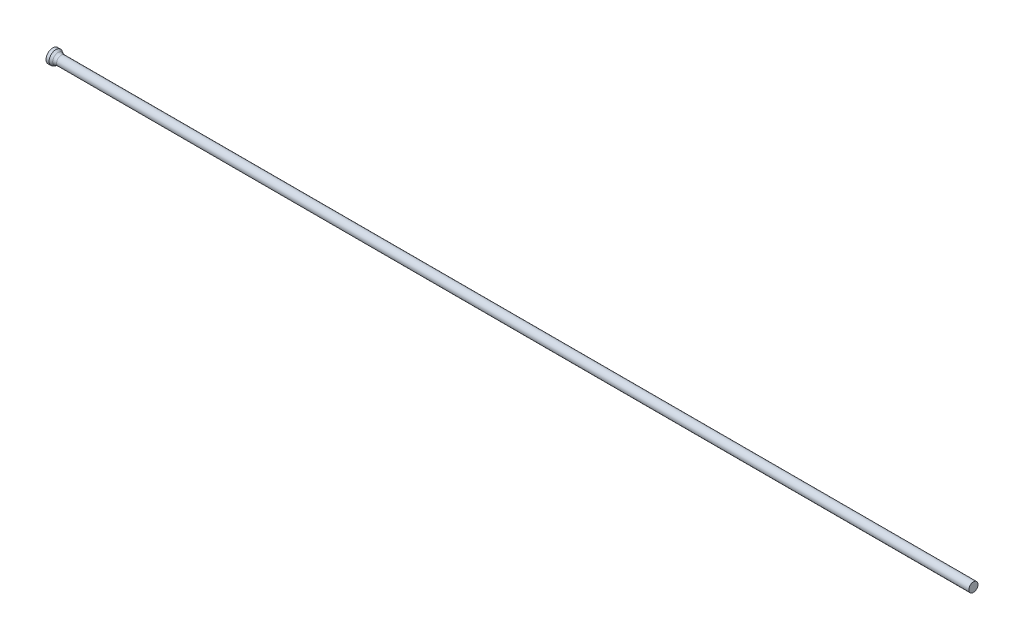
ISO-10303-21;
HEADER;
FILE_DESCRIPTION(('STEP AP214'),'2;1');
FILE_NAME('part.step','',(''),(''),'','','');
FILE_SCHEMA(('AUTOMOTIVE_DESIGN { 1 0 10303 214 1 1 1 1 }'));
ENDSEC;
DATA;
#1=APPLICATION_CONTEXT('core data for automotive mechanical design processes');
#2=APPLICATION_PROTOCOL_DEFINITION('international standard','automotive_design',2000,#1);
#3=PRODUCT_CONTEXT('',#1,'mechanical');
#4=PRODUCT('Part','Part','',(#3));
#5=PRODUCT_RELATED_PRODUCT_CATEGORY('part','',(#4));
#6=PRODUCT_DEFINITION_FORMATION('','',#4);
#7=PRODUCT_DEFINITION_CONTEXT('part definition',#1,'design');
#8=PRODUCT_DEFINITION('design','',#6,#7);
#9=PRODUCT_DEFINITION_SHAPE('','',#8);
#10=(LENGTH_UNIT() NAMED_UNIT(*) SI_UNIT(.MILLI.,.METRE.));
#11=(NAMED_UNIT(*) PLANE_ANGLE_UNIT() SI_UNIT($,.RADIAN.));
#12=(NAMED_UNIT(*) SI_UNIT($,.STERADIAN.) SOLID_ANGLE_UNIT());
#13=UNCERTAINTY_MEASURE_WITH_UNIT(LENGTH_MEASURE(1.E-05),#10,'distance_accuracy_value','');
#14=(GEOMETRIC_REPRESENTATION_CONTEXT(3) GLOBAL_UNCERTAINTY_ASSIGNED_CONTEXT((#13)) GLOBAL_UNIT_ASSIGNED_CONTEXT((#10,
#11,#12)) REPRESENTATION_CONTEXT('',''));
#15=CARTESIAN_POINT('',(0.,0.,0.));
#16=DIRECTION('',(0.,0.,1.));
#17=DIRECTION('',(1.,0.,0.));
#18=AXIS2_PLACEMENT_3D('',#15,#16,#17);
#19=CARTESIAN_POINT('',(0.,0.,0.));
#20=DIRECTION('',(1.,0.,0.));
#21=DIRECTION('',(0.,0.,-1.));
#22=AXIS2_PLACEMENT_3D('',#19,#20,#21);
#23=PLANE('',#22);
#24=CARTESIAN_POINT('',(0.,0.,0.));
#25=DIRECTION('',(-1.,0.,0.));
#26=DIRECTION('',(0.,0.,1.));
#27=AXIS2_PLACEMENT_3D('',#24,#25,#26);
#28=CIRCLE('',#27,1.1);
#29=CARTESIAN_POINT('',(0.,0.,1.1));
#30=VERTEX_POINT('',#29);
#31=EDGE_CURVE('E25',#30,#30,#28,.T.);
#32=ORIENTED_EDGE('',*,*,#31,.T.);
#33=EDGE_LOOP('',(#32));
#34=FACE_BOUND('',#33,.T.);
#35=ADVANCED_FACE('F14',(#34),#23,.F.);
#36=CARTESIAN_POINT('',(0.,0.,0.));
#37=DIRECTION('',(-1.,0.,0.));
#38=DIRECTION('',(0.,0.,1.));
#39=AXIS2_PLACEMENT_3D('',#36,#37,#38);
#40=CYLINDRICAL_SURFACE('',#39,1.1);
#41=ORIENTED_EDGE('',*,*,#31,.F.);
#42=EDGE_LOOP('',(#41));
#43=FACE_BOUND('',#42,.T.);
#44=CARTESIAN_POINT('',(0.503782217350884,0.,0.));
#45=DIRECTION('',(-1.,0.,0.));
#46=DIRECTION('',(0.,0.,1.));
#47=AXIS2_PLACEMENT_3D('',#44,#45,#46);
#48=CIRCLE('',#47,1.1);
#49=CARTESIAN_POINT('',(0.503782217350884,0.,1.1));
#50=VERTEX_POINT('',#49);
#51=EDGE_CURVE('E29',#50,#50,#48,.T.);
#52=ORIENTED_EDGE('',*,*,#51,.T.);
#53=EDGE_LOOP('',(#52));
#54=FACE_BOUND('',#53,.T.);
#55=ADVANCED_FACE('F53',(#43,#54),#40,.T.);
#56=CARTESIAN_POINT('',(1.11,0.,0.));
#57=DIRECTION('',(-1.,0.,0.));
#58=DIRECTION('',(0.,0.,1.));
#59=AXIS2_PLACEMENT_3D('',#56,#57,#58);
#60=CONICAL_SURFACE('',#59,0.75,0.523598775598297);
#61=CARTESIAN_POINT('',(0.877949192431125,0.,0.));
#62=DIRECTION('',(-1.,0.,0.));
#63=DIRECTION('',(0.,0.,1.));
#64=AXIS2_PLACEMENT_3D('',#61,#62,#63);
#65=CIRCLE('',#64,0.883974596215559);
#66=CARTESIAN_POINT('',(0.877949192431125,0.,0.883974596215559));
#67=VERTEX_POINT('',#66);
#68=EDGE_CURVE('E21',#67,#67,#65,.T.);
#69=ORIENTED_EDGE('',*,*,#68,.T.);
#70=EDGE_LOOP('',(#69));
#71=FACE_BOUND('',#70,.T.);
#72=ORIENTED_EDGE('',*,*,#51,.F.);
#73=EDGE_LOOP('',(#72));
#74=FACE_BOUND('',#73,.T.);
#75=ADVANCED_FACE('F50',(#71,#74),#60,.T.);
#76=CARTESIAN_POINT('',(0.,0.,0.));
#77=DIRECTION('',(-1.,0.,0.));
#78=DIRECTION('',(0.,0.,1.));
#79=AXIS2_PLACEMENT_3D('',#76,#77,#78);
#80=CYLINDRICAL_SURFACE('',#79,0.75);
#81=CARTESIAN_POINT('',(1.37794919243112,0.,0.));
#82=DIRECTION('',(-1.,0.,0.));
#83=DIRECTION('',(0.,0.,1.));
#84=AXIS2_PLACEMENT_3D('',#81,#82,#83);
#85=CIRCLE('',#84,0.75);
#86=CARTESIAN_POINT('',(1.37794919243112,0.,0.75));
#87=VERTEX_POINT('',#86);
#88=EDGE_CURVE('E9',#87,#87,#85,.F.);
#89=ORIENTED_EDGE('',*,*,#88,.T.);
#90=EDGE_LOOP('',(#89));
#91=FACE_BOUND('',#90,.T.);
#92=CARTESIAN_POINT('',(150.,0.,0.));
#93=DIRECTION('',(-1.,0.,0.));
#94=DIRECTION('',(0.,0.,1.));
#95=AXIS2_PLACEMENT_3D('',#92,#93,#94);
#96=CIRCLE('',#95,0.75);
#97=CARTESIAN_POINT('',(150.,0.,0.75));
#98=VERTEX_POINT('',#97);
#99=EDGE_CURVE('E34',#98,#98,#96,.T.);
#100=ORIENTED_EDGE('',*,*,#99,.T.);
#101=EDGE_LOOP('',(#100));
#102=FACE_BOUND('',#101,.T.);
#103=ADVANCED_FACE('F38',(#91,#102),#80,.T.);
#104=CARTESIAN_POINT('',(150.,0.75,0.));
#105=DIRECTION('',(-1.,0.,0.));
#106=DIRECTION('',(0.,0.,1.));
#107=AXIS2_PLACEMENT_3D('',#104,#105,#106);
#108=PLANE('',#107);
#109=ORIENTED_EDGE('',*,*,#99,.F.);
#110=EDGE_LOOP('',(#109));
#111=FACE_BOUND('',#110,.T.);
#112=ADVANCED_FACE('F40',(#111),#108,.F.);
#113=CARTESIAN_POINT('',(1.37794919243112,0.,0.));
#114=DIRECTION('',(-1.,0.,0.));
#115=DIRECTION('',(0.,0.,1.));
#116=AXIS2_PLACEMENT_3D('',#113,#114,#115);
#117=TOROIDAL_SURFACE('',#116,1.75,1.);
#118=ORIENTED_EDGE('',*,*,#88,.F.);
#119=EDGE_LOOP('',(#118));
#120=FACE_BOUND('',#119,.T.);
#121=ORIENTED_EDGE('',*,*,#68,.F.);
#122=EDGE_LOOP('',(#121));
#123=FACE_BOUND('',#122,.T.);
#124=ADVANCED_FACE('F16',(#120,#123),#117,.F.);
#125=CLOSED_SHELL('',(#35,#55,#75,#103,#112,#124));
#126=MANIFOLD_SOLID_BREP('B1',#125);
#127=ADVANCED_BREP_SHAPE_REPRESENTATION('',(#18,#126),#14);
#128=SHAPE_DEFINITION_REPRESENTATION(#9,#127);
ENDSEC;
END-ISO-10303-21;
